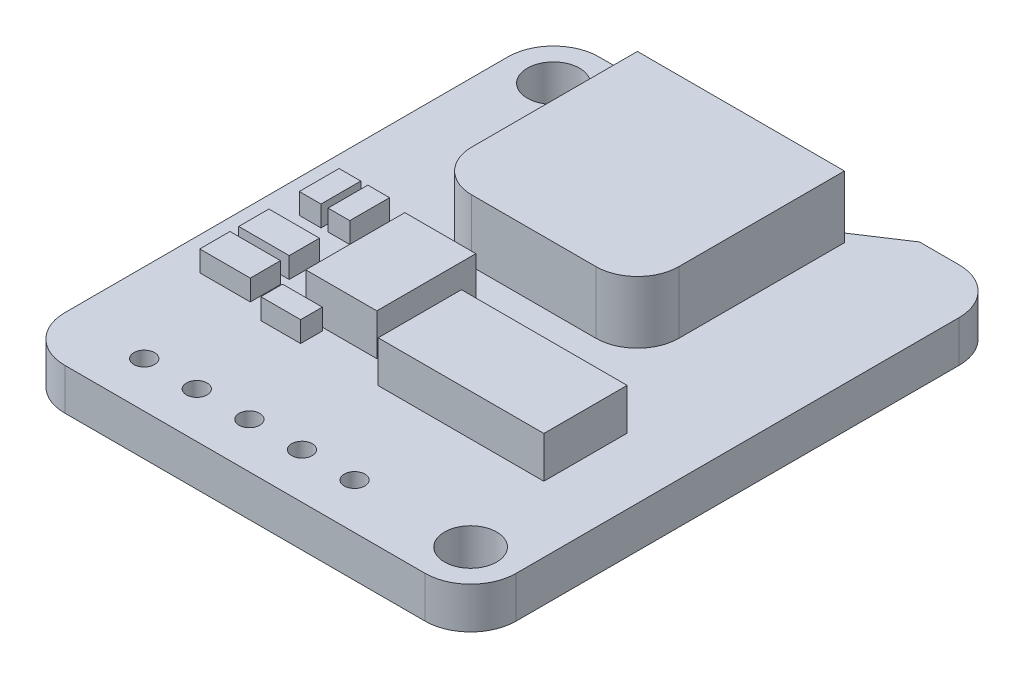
from build123d import *

# Parameters (mm, degrees)
SKETCH1_R        = 1.25963535
SKETCH1_R_2      = 0.5
BOARD_DEPTH      = 2
CELL_MOUNT_DEPTH = 3
SKETCH3_W        = 3.430402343
SKETCH3_H        = 4.78497712
SKETCH3_W_2      = 8.002036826
SKETCH3_H_2      = 4.022247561
CHIPS_DEPTH      = 2
SKETCH4_W        = 1.0488207
SKETCH4_H        = 1.920981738
SKETCH4_W_2      = 1.048820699
SKETCH4_W_3      = 1.920981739
SKETCH4_H_2      = 1.048820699
SKETCH4_W_4      = 2.43815955
SKETCH4_H_3      = 1.459073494
SKETCH4_H_4      = 1.459073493
RESISTORS_DEPTH  = 1


with BuildPart() as part:
    # Sketch1 → Board (new body)
    with BuildSketch(Plane(origin=(0, 0, 0), x_dir=(1, 0, 0), z_dir=(0, 1, 0))):
        with BuildLine():
            Line((4.480914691, 25.8), (6.268230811, 24.012683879))
            ThreePointArc((6.268230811, 24.012683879), (6.917077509, 23.579138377), (7.682444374, 23.426897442))
            Line((7.682444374, 23.426897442), (13.475358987, 23.426897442))
            ThreePointArc((13.475358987, 23.426897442), (14.048902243, 23.510899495), (14.574266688, 23.755849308))
            Line((14.574266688, 23.755849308), (17.682693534, 25.8))
            Line((17.682693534, 25.8), (19.6, 25.8))
            ThreePointArc((19.6, 25.8), (21.155634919, 25.155634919), (21.8, 23.6))
            Line((21.8, 23.6), (21.8, 2.2))
            ThreePointArc((21.8, 2.2), (21.155634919, 0.644365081), (19.6, 0))
            Line((19.6, 0), (2.2, 0))
            ThreePointArc((2.2, 0), (0.644365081, 0.644365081), (0, 2.2))
            Line((0, 2.2), (0, 23.6))
            ThreePointArc((0, 23.6), (0.644365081, 25.155634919), (2.2, 25.8))
            Line((2.2, 25.8), (4.480914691, 25.8))
        make_face()
        with Locations(Location((2.2, 23.6, 0), (0, 0, 270))):
            Circle(SKETCH1_R, mode=Mode.SUBTRACT)
        with Locations(Location((19.6, 2.2, 0), (0, 0, 270))):
            Circle(SKETCH1_R, mode=Mode.SUBTRACT)
        with Locations(Location((3.836868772, 2.2, 0), (0, 0, 270))):
            Circle(SKETCH1_R_2, mode=Mode.SUBTRACT)
        with Locations(Location((6.376868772, 2.2, 0), (0, 0, 270))):
            Circle(SKETCH1_R_2, mode=Mode.SUBTRACT)
        with Locations(Location((8.916868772, 2.2, 0), (0, 0, 270))):
            Circle(SKETCH1_R_2, mode=Mode.SUBTRACT)
        with Locations(Location((11.456868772, 2.2, 0), (0, 0, 270))):
            Circle(SKETCH1_R_2, mode=Mode.SUBTRACT)
        with Locations(Location((13.996868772, 2.2, 0), (0, 0, 270))):
            Circle(SKETCH1_R_2, mode=Mode.SUBTRACT)
    extrude(amount=BOARD_DEPTH)

    # Sketch2 → Cell mount (add)
    with BuildSketch(Plane(origin=(0, 2, 0), x_dir=(1, 0, 0), z_dir=(0, 1, 0))):
        with BuildLine():
            Line((7.9, 13.95588588), (13.9, 13.95588588))
            ThreePointArc((13.9, 13.95588588), (15.314213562, 14.541672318), (15.9, 15.95588588))
            Line((15.9, 15.95588588), (15.9, 23.95588588))
            Line((15.9, 23.95588588), (5.9, 23.95588588))
            Line((5.9, 23.95588588), (5.9, 15.95588588))
            ThreePointArc((5.9, 15.95588588), (6.485786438, 14.541672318), (7.9, 13.95588588))
        make_face()
    extrude(amount=CELL_MOUNT_DEPTH)

    # Sketch3 → Chips (add)
    with BuildSketch(Plane(origin=(0, 2, 0), x_dir=(1, 0, 0), z_dir=(0, 1, 0))):
        with Locations((7.741396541, 10.205439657)):
            Rectangle(SKETCH3_W, SKETCH3_H)
        with Locations((14.618455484, 8.729812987)):
            Rectangle(SKETCH3_W_2, SKETCH3_H_2)
    extrude(amount=CHIPS_DEPTH)

    # Sketch4 → Resistors (add)
    with BuildSketch(Plane(origin=(0, 2, 0), x_dir=(1, 0, 0), z_dir=(0, 1, 0))):
        with Locations((2.117666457, 12.894342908)):
            Rectangle(SKETCH4_W, SKETCH4_H)
        with Locations((3.507005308, 12.894342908)):
            Rectangle(SKETCH4_W_2, SKETCH4_H)
        with Locations((6.02619537, 7.128664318)):
            Rectangle(SKETCH4_W_3, SKETCH4_H_2)
        with Locations((2.812335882, 7.858201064)):
            Rectangle(SKETCH4_W_4, SKETCH4_H_3)
        with Locations((2.812335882, 9.738170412)):
            Rectangle(SKETCH4_W_4, SKETCH4_H_4)
    extrude(amount=RESISTORS_DEPTH)


solid = part.part
